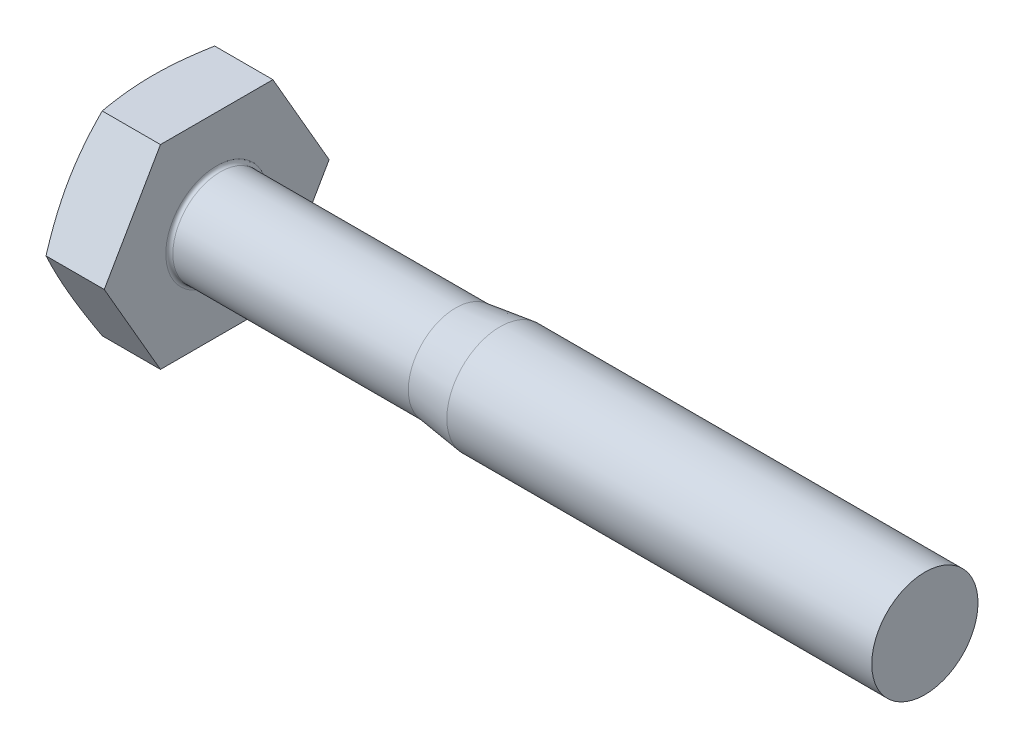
ISO-10303-21;
HEADER;
FILE_DESCRIPTION(('STEP AP214'),'2;1');
FILE_NAME('part.step','',(''),(''),'','','');
FILE_SCHEMA(('AUTOMOTIVE_DESIGN { 1 0 10303 214 1 1 1 1 }'));
ENDSEC;
DATA;
#1=APPLICATION_CONTEXT('core data for automotive mechanical design processes');
#2=APPLICATION_PROTOCOL_DEFINITION('international standard','automotive_design',2000,#1);
#3=PRODUCT_CONTEXT('',#1,'mechanical');
#4=PRODUCT('Part','Part','',(#3));
#5=PRODUCT_RELATED_PRODUCT_CATEGORY('part','',(#4));
#6=PRODUCT_DEFINITION_FORMATION('','',#4);
#7=PRODUCT_DEFINITION_CONTEXT('part definition',#1,'design');
#8=PRODUCT_DEFINITION('design','',#6,#7);
#9=PRODUCT_DEFINITION_SHAPE('','',#8);
#10=(LENGTH_UNIT() NAMED_UNIT(*) SI_UNIT(.MILLI.,.METRE.));
#11=(NAMED_UNIT(*) PLANE_ANGLE_UNIT() SI_UNIT($,.RADIAN.));
#12=(NAMED_UNIT(*) SI_UNIT($,.STERADIAN.) SOLID_ANGLE_UNIT());
#13=UNCERTAINTY_MEASURE_WITH_UNIT(LENGTH_MEASURE(1.E-05),#10,'distance_accuracy_value','');
#14=(GEOMETRIC_REPRESENTATION_CONTEXT(3) GLOBAL_UNCERTAINTY_ASSIGNED_CONTEXT((#13)) GLOBAL_UNIT_ASSIGNED_CONTEXT((#10,
#11,#12)) REPRESENTATION_CONTEXT('',''));
#15=CARTESIAN_POINT('',(0.,0.,0.));
#16=DIRECTION('',(0.,0.,1.));
#17=DIRECTION('',(1.,0.,0.));
#18=AXIS2_PLACEMENT_3D('',#15,#16,#17);
#19=CARTESIAN_POINT('',(2.,-2.75,-1.58771324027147));
#20=DIRECTION('',(0.,0.5,0.866025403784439));
#21=DIRECTION('',(0.,-0.866025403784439,0.5));
#22=AXIS2_PLACEMENT_3D('',#19,#20,#21);
#23=PLANE('',#22);
#24=CARTESIAN_POINT('',(0.355068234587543,0.00019999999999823,-3.17554195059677));
#25=CARTESIAN_POINT('',(0.331123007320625,-0.113699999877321,-3.10978175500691));
#26=CARTESIAN_POINT('',(0.309340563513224,-0.227975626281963,-3.04380469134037));
#27=CARTESIAN_POINT('',(0.271017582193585,-0.457270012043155,-2.91142151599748));
#28=CARTESIAN_POINT('',(0.25448114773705,-0.572289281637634,-2.84501510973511));
#29=CARTESIAN_POINT('',(0.227733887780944,-0.801794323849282,-2.71251031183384));
#30=CARTESIAN_POINT('',(0.217464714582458,-0.916274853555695,-2.64641494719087));
#31=CARTESIAN_POINT('',(0.203690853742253,-1.14550366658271,-2.51406963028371));
#32=CARTESIAN_POINT('',(0.200183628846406,-1.26025183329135,-2.44781974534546));
#33=CARTESIAN_POINT('',(0.200183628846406,-1.48974816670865,-2.31531997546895));
#34=CARTESIAN_POINT('',(0.203690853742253,-1.60449633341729,-2.2490700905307));
#35=CARTESIAN_POINT('',(0.217464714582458,-1.83372514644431,-2.11672477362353));
#36=CARTESIAN_POINT('',(0.227733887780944,-1.94820567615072,-2.05062940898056));
#37=CARTESIAN_POINT('',(0.254481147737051,-2.17771071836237,-1.91812461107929));
#38=CARTESIAN_POINT('',(0.271017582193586,-2.29272998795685,-1.85171820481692));
#39=CARTESIAN_POINT('',(0.309340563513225,-2.52202437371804,-1.71933502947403));
#40=CARTESIAN_POINT('',(0.331123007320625,-2.63630000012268,-1.6533579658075));
#41=CARTESIAN_POINT('',(0.355068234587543,-2.7502,-1.58759777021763));
#42=B_SPLINE_CURVE_WITH_KNOTS('',3,(#24,#25,#26,#27,#28,#29,#30,#31,#32,#33,#34,#35,#36,#37,#38,
#39,#40,#41),.UNSPECIFIED.,.F.,.F.,(4,2,2,2,2,2,2,2,4),(0.,0.401088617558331,0.802490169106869,
1.20009530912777,1.5975512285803,1.99500714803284,2.39261228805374,2.79401383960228,
3.19510245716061),.UNSPECIFIED.);
#43=CARTESIAN_POINT('',(0.355026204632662,0.,-3.17542648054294));
#44=VERTEX_POINT('',#43);
#45=CARTESIAN_POINT('',(0.355026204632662,-2.75,-1.58771324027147));
#46=VERTEX_POINT('',#45);
#47=EDGE_CURVE('E47',#44,#46,#42,.T.);
#48=ORIENTED_EDGE('',*,*,#47,.F.);
#49=DIRECTION('',(-1.,0.,0.));
#50=VECTOR('',#49,1.);
#51=CARTESIAN_POINT('',(2.,0.,-3.17542648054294));
#52=LINE('',#51,#50);
#53=CARTESIAN_POINT('',(2.,0.,-3.17542648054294));
#54=VERTEX_POINT('',#53);
#55=EDGE_CURVE('E118',#54,#44,#52,.T.);
#56=ORIENTED_EDGE('',*,*,#55,.F.);
#57=DIRECTION('',(0.,0.866025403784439,-0.5));
#58=VECTOR('',#57,1.);
#59=CARTESIAN_POINT('',(2.,-2.75,-1.58771324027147));
#60=LINE('',#59,#58);
#61=CARTESIAN_POINT('',(2.,-2.75,-1.58771324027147));
#62=VERTEX_POINT('',#61);
#63=EDGE_CURVE('E157',#62,#54,#60,.T.);
#64=ORIENTED_EDGE('',*,*,#63,.F.);
#65=DIRECTION('',(-1.,0.,0.));
#66=VECTOR('',#65,1.);
#67=CARTESIAN_POINT('',(2.,-2.75,-1.58771324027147));
#68=LINE('',#67,#66);
#69=EDGE_CURVE('E112',#62,#46,#68,.T.);
#70=ORIENTED_EDGE('',*,*,#69,.T.);
#71=EDGE_LOOP('',(#48,#56,#64,#70));
#72=FACE_BOUND('',#71,.T.);
#73=ADVANCED_FACE('F32',(#72),#23,.F.);
#74=CARTESIAN_POINT('',(2.,0.,-3.17542648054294));
#75=DIRECTION('',(0.,-0.5,0.866025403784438));
#76=DIRECTION('',(0.,-0.866025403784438,-0.5));
#77=AXIS2_PLACEMENT_3D('',#74,#75,#76);
#78=PLANE('',#77);
#79=CARTESIAN_POINT('',(0.355068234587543,2.7502,-1.58759777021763));
#80=CARTESIAN_POINT('',(0.331123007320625,2.63630000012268,-1.65335796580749));
#81=CARTESIAN_POINT('',(0.309340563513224,2.52202437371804,-1.71933502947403));
#82=CARTESIAN_POINT('',(0.271017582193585,2.29272998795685,-1.85171820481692));
#83=CARTESIAN_POINT('',(0.25448114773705,2.17771071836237,-1.91812461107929));
#84=CARTESIAN_POINT('',(0.227733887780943,1.94820567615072,-2.05062940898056));
#85=CARTESIAN_POINT('',(0.217464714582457,1.83372514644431,-2.11672477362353));
#86=CARTESIAN_POINT('',(0.203690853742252,1.60449633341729,-2.24907009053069));
#87=CARTESIAN_POINT('',(0.200183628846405,1.48974816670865,-2.31531997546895));
#88=CARTESIAN_POINT('',(0.200183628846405,1.26025183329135,-2.44781974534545));
#89=CARTESIAN_POINT('',(0.203690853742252,1.14550366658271,-2.51406963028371));
#90=CARTESIAN_POINT('',(0.217464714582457,0.916274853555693,-2.64641494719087));
#91=CARTESIAN_POINT('',(0.227733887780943,0.80179432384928,-2.71251031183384));
#92=CARTESIAN_POINT('',(0.25448114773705,0.572289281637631,-2.84501510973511));
#93=CARTESIAN_POINT('',(0.271017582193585,0.457270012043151,-2.91142151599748));
#94=CARTESIAN_POINT('',(0.309340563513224,0.22797562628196,-3.04380469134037));
#95=CARTESIAN_POINT('',(0.331123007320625,0.113699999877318,-3.10978175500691));
#96=CARTESIAN_POINT('',(0.355068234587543,-0.000200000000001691,-3.17554195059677));
#97=B_SPLINE_CURVE_WITH_KNOTS('',3,(#79,#80,#81,#82,#83,#84,#85,#86,#87,#88,#89,#90,#91,#92,#93,
#94,#95,#96),.UNSPECIFIED.,.F.,.F.,(4,2,2,2,2,2,2,2,4),(0.,0.401088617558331,0.80249016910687,
1.20009530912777,1.59755122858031,1.99500714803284,2.39261228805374,2.79401383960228,
3.19510245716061),.UNSPECIFIED.);
#98=CARTESIAN_POINT('',(0.355026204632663,2.75,-1.58771324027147));
#99=VERTEX_POINT('',#98);
#100=EDGE_CURVE('E150',#99,#44,#97,.T.);
#101=ORIENTED_EDGE('',*,*,#100,.F.);
#102=DIRECTION('',(-1.,0.,0.));
#103=VECTOR('',#102,1.);
#104=CARTESIAN_POINT('',(2.,2.75,-1.58771324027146));
#105=LINE('',#104,#103);
#106=CARTESIAN_POINT('',(2.,2.75,-1.58771324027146));
#107=VERTEX_POINT('',#106);
#108=EDGE_CURVE('E110',#107,#99,#105,.T.);
#109=ORIENTED_EDGE('',*,*,#108,.F.);
#110=DIRECTION('',(0.,0.866025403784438,0.5));
#111=VECTOR('',#110,1.);
#112=CARTESIAN_POINT('',(2.,0.,-3.17542648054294));
#113=LINE('',#112,#111);
#114=EDGE_CURVE('E154',#54,#107,#113,.T.);
#115=ORIENTED_EDGE('',*,*,#114,.F.);
#116=ORIENTED_EDGE('',*,*,#55,.T.);
#117=EDGE_LOOP('',(#101,#109,#115,#116));
#118=FACE_BOUND('',#117,.T.);
#119=ADVANCED_FACE('F139',(#118),#78,.F.);
#120=CARTESIAN_POINT('',(2.,2.75,-1.58771324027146));
#121=DIRECTION('',(0.,-1.,0.));
#122=DIRECTION('',(0.,0.,-1.));
#123=AXIS2_PLACEMENT_3D('',#120,#121,#122);
#124=PLANE('',#123);
#125=CARTESIAN_POINT('',(1.02180493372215,2.75,-4.18466418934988));
#126=CARTESIAN_POINT('',(0.984029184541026,2.75,-4.06043601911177));
#127=CARTESIAN_POINT('',(0.946698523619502,2.75,-3.93607007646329));
#128=CARTESIAN_POINT('',(0.873173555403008,2.75,-3.68699229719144));
#129=CARTESIAN_POINT('',(0.836979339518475,2.75,-3.56228043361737));
#130=CARTESIAN_POINT('',(0.765912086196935,2.75,-3.31222289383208));
#131=CARTESIAN_POINT('',(0.731041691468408,2.75,-3.18687646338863));
#132=CARTESIAN_POINT('',(0.663035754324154,2.75,-2.93571540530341));
#133=CARTESIAN_POINT('',(0.629900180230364,2.75,-2.80990078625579));
#134=CARTESIAN_POINT('',(0.566197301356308,2.75,-2.55931264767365));
#135=CARTESIAN_POINT('',(0.535602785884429,2.75,-2.4345461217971));
#136=CARTESIAN_POINT('',(0.477051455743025,2.75,-2.184397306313));
#137=CARTESIAN_POINT('',(0.449094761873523,2.75,-2.0590149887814));
#138=CARTESIAN_POINT('',(0.370146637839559,2.75,-1.68189911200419));
#139=CARTESIAN_POINT('',(0.324042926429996,2.75,-1.42906708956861));
#140=CARTESIAN_POINT('',(0.271566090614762,2.75,-1.06200278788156));
#141=CARTESIAN_POINT('',(0.257356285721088,2.75,-0.948883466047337));
#142=CARTESIAN_POINT('',(0.233368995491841,2.75,-0.722180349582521));
#143=CARTESIAN_POINT('',(0.223590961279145,2.75,-0.608596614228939));
#144=CARTESIAN_POINT('',(0.208933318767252,2.75,-0.381182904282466));
#145=CARTESIAN_POINT('',(0.204050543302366,2.75,-0.267353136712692));
#146=CARTESIAN_POINT('',(0.199431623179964,2.75,-0.0395878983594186));
#147=CARTESIAN_POINT('',(0.199695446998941,2.75,0.0743475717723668));
#148=CARTESIAN_POINT('',(0.20536982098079,2.75,0.30268219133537));
#149=CARTESIAN_POINT('',(0.210807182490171,2.75,0.417080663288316));
#150=CARTESIAN_POINT('',(0.226579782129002,2.75,0.6455406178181));
#151=CARTESIAN_POINT('',(0.236915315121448,2.75,0.759602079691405));
#152=CARTESIAN_POINT('',(0.262003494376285,2.75,0.987328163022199));
#153=CARTESIAN_POINT('',(0.276759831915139,2.75,1.10099237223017));
#154=CARTESIAN_POINT('',(0.310100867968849,2.75,1.32775044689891));
#155=CARTESIAN_POINT('',(0.328685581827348,2.75,1.44084431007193));
#156=CARTESIAN_POINT('',(0.39209052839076,2.75,1.79506991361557));
#157=CARTESIAN_POINT('',(0.442664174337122,2.75,2.03516887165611));
#158=CARTESIAN_POINT('',(0.553526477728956,2.75,2.51311988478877));
#159=CARTESIAN_POINT('',(0.613818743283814,2.75,2.75097107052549));
#160=CARTESIAN_POINT('',(0.74084566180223,2.75,3.22526685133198));
#161=CARTESIAN_POINT('',(0.807588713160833,2.75,3.46170917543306));
#162=CARTESIAN_POINT('',(0.945321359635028,2.75,3.93329901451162));
#163=CARTESIAN_POINT('',(1.01631025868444,2.75,4.16844673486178));
#164=CARTESIAN_POINT('',(1.16035963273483,2.75,4.63505812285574));
#165=CARTESIAN_POINT('',(1.23338567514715,2.75,4.86653246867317));
#166=CARTESIAN_POINT('',(1.38147888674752,2.75,5.32883776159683));
#167=CARTESIAN_POINT('',(1.45654615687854,2.75,5.55966867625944));
#168=CARTESIAN_POINT('',(1.60787522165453,2.75,6.01995774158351));
#169=CARTESIAN_POINT('',(1.68413133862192,2.75,6.24941776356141));
#170=CARTESIAN_POINT('',(1.83776576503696,2.75,6.70794092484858));
#171=CARTESIAN_POINT('',(1.91514398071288,2.75,6.93700409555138));
#172=CARTESIAN_POINT('',(1.99291392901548,2.75,7.16593229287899));
#173=B_SPLINE_CURVE_WITH_KNOTS('',3,(#125,#126,#127,#128,#129,#130,#131,#132,#133,#134,#135,
#136,#137,#138,#139,#140,#141,#142,#143,#144,#145,#146,#147,#148,#149,#150,#151,#152,#153,#154,
#155,#156,#157,#158,#159,#160,#161,#162,#163,#164,#165,#166,#167,#168,#169,#170,#171,#172),
.UNSPECIFIED.,.F.,.F.,(4,2,2,2,2,2,2,2,2,2,2,2,2,2,2,2,2,2,2,2,2,2,2,4),(0.,0.389536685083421,
0.779104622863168,1.16941322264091,1.55971469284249,1.94507331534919,2.33044957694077,
3.10080042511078,3.44275550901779,3.78466823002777,4.12635959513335,4.46804886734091,
4.81151861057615,5.15500903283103,5.49878706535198,5.84256647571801,6.57830519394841,
7.31431769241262,8.05130166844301,8.78816515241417,9.51631330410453,10.2444975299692,
10.9698921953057,11.6952265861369),.UNSPECIFIED.);
#174=CARTESIAN_POINT('',(0.355026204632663,2.75,1.58771324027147));
#175=VERTEX_POINT('',#174);
#176=EDGE_CURVE('E104',#175,#99,#173,.F.);
#177=ORIENTED_EDGE('',*,*,#176,.F.);
#178=DIRECTION('',(-1.,0.,0.));
#179=VECTOR('',#178,1.);
#180=CARTESIAN_POINT('',(2.,2.75,1.58771324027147));
#181=LINE('',#180,#179);
#182=CARTESIAN_POINT('',(2.,2.75,1.58771324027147));
#183=VERTEX_POINT('',#182);
#184=EDGE_CURVE('E103',#183,#175,#181,.T.);
#185=ORIENTED_EDGE('',*,*,#184,.F.);
#186=DIRECTION('',(0.,0.,1.));
#187=VECTOR('',#186,1.);
#188=CARTESIAN_POINT('',(2.,2.75,-1.58771324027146));
#189=LINE('',#188,#187);
#190=EDGE_CURVE('E156',#107,#183,#189,.T.);
#191=ORIENTED_EDGE('',*,*,#190,.F.);
#192=ORIENTED_EDGE('',*,*,#108,.T.);
#193=EDGE_LOOP('',(#177,#185,#191,#192));
#194=FACE_BOUND('',#193,.T.);
#195=ADVANCED_FACE('F144',(#194),#124,.F.);
#196=CARTESIAN_POINT('',(2.,2.75,1.58771324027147));
#197=DIRECTION('',(0.,-0.5,-0.866025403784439));
#198=DIRECTION('',(0.,0.866025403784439,-0.5));
#199=AXIS2_PLACEMENT_3D('',#196,#197,#198);
#200=PLANE('',#199);
#201=CARTESIAN_POINT('',(0.355068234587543,-0.000199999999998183,3.17554195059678));
#202=CARTESIAN_POINT('',(0.331123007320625,0.113699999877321,3.10978175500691));
#203=CARTESIAN_POINT('',(0.309340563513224,0.227975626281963,3.04380469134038));
#204=CARTESIAN_POINT('',(0.271017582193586,0.457270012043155,2.91142151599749));
#205=CARTESIAN_POINT('',(0.25448114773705,0.572289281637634,2.84501510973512));
#206=CARTESIAN_POINT('',(0.227733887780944,0.801794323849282,2.71251031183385));
#207=CARTESIAN_POINT('',(0.217464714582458,0.916274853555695,2.64641494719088));
#208=CARTESIAN_POINT('',(0.203690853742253,1.14550366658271,2.51406963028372));
#209=CARTESIAN_POINT('',(0.200183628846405,1.26025183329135,2.44781974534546));
#210=CARTESIAN_POINT('',(0.200183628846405,1.48974816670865,2.31531997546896));
#211=CARTESIAN_POINT('',(0.203690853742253,1.60449633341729,2.2490700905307));
#212=CARTESIAN_POINT('',(0.217464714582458,1.83372514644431,2.11672477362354));
#213=CARTESIAN_POINT('',(0.227733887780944,1.94820567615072,2.05062940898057));
#214=CARTESIAN_POINT('',(0.25448114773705,2.17771071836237,1.9181246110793));
#215=CARTESIAN_POINT('',(0.271017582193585,2.29272998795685,1.85171820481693));
#216=CARTESIAN_POINT('',(0.309340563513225,2.52202437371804,1.71933502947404));
#217=CARTESIAN_POINT('',(0.331123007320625,2.63630000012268,1.65335796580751));
#218=CARTESIAN_POINT('',(0.355068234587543,2.7502,1.58759777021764));
#219=B_SPLINE_CURVE_WITH_KNOTS('',3,(#201,#202,#203,#204,#205,#206,#207,#208,#209,#210,#211,
#212,#213,#214,#215,#216,#217,#218),.UNSPECIFIED.,.F.,.F.,(4,2,2,2,2,2,2,2,4),(0.,
0.401088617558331,0.802490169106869,1.20009530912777,1.5975512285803,1.99500714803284,
2.39261228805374,2.79401383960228,3.19510245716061),.UNSPECIFIED.);
#220=CARTESIAN_POINT('',(0.355026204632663,0.,3.17542648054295));
#221=VERTEX_POINT('',#220);
#222=EDGE_CURVE('E87',#221,#175,#219,.T.);
#223=ORIENTED_EDGE('',*,*,#222,.F.);
#224=DIRECTION('',(-1.,0.,0.));
#225=VECTOR('',#224,1.);
#226=CARTESIAN_POINT('',(2.,0.,3.17542648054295));
#227=LINE('',#226,#225);
#228=CARTESIAN_POINT('',(2.,0.,3.17542648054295));
#229=VERTEX_POINT('',#228);
#230=EDGE_CURVE('E100',#229,#221,#227,.T.);
#231=ORIENTED_EDGE('',*,*,#230,.F.);
#232=DIRECTION('',(0.,-0.866025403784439,0.5));
#233=VECTOR('',#232,1.);
#234=CARTESIAN_POINT('',(2.,2.75,1.58771324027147));
#235=LINE('',#234,#233);
#236=EDGE_CURVE('E164',#183,#229,#235,.T.);
#237=ORIENTED_EDGE('',*,*,#236,.F.);
#238=ORIENTED_EDGE('',*,*,#184,.T.);
#239=EDGE_LOOP('',(#223,#231,#237,#238));
#240=FACE_BOUND('',#239,.T.);
#241=ADVANCED_FACE('F98',(#240),#200,.F.);
#242=CARTESIAN_POINT('',(2.,0.,3.17542648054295));
#243=DIRECTION('',(0.,0.5,-0.866025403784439));
#244=DIRECTION('',(0.,0.866025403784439,0.5));
#245=AXIS2_PLACEMENT_3D('',#242,#243,#244);
#246=PLANE('',#245);
#247=CARTESIAN_POINT('',(0.355068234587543,-2.7502,1.58759777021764));
#248=CARTESIAN_POINT('',(0.331123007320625,-2.63630000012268,1.65335796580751));
#249=CARTESIAN_POINT('',(0.309340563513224,-2.52202437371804,1.71933502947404));
#250=CARTESIAN_POINT('',(0.271017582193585,-2.29272998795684,1.85171820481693));
#251=CARTESIAN_POINT('',(0.25448114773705,-2.17771071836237,1.9181246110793));
#252=CARTESIAN_POINT('',(0.227733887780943,-1.94820567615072,2.05062940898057));
#253=CARTESIAN_POINT('',(0.217464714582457,-1.8337251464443,2.11672477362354));
#254=CARTESIAN_POINT('',(0.203690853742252,-1.60449633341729,2.2490700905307));
#255=CARTESIAN_POINT('',(0.200183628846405,-1.48974816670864,2.31531997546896));
#256=CARTESIAN_POINT('',(0.200183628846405,-1.26025183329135,2.44781974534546));
#257=CARTESIAN_POINT('',(0.203690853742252,-1.14550366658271,2.51406963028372));
#258=CARTESIAN_POINT('',(0.217464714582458,-0.916274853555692,2.64641494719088));
#259=CARTESIAN_POINT('',(0.227733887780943,-0.801794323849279,2.71251031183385));
#260=CARTESIAN_POINT('',(0.25448114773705,-0.57228928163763,2.84501510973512));
#261=CARTESIAN_POINT('',(0.271017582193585,-0.457270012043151,2.91142151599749));
#262=CARTESIAN_POINT('',(0.309340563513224,-0.227975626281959,3.04380469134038));
#263=CARTESIAN_POINT('',(0.331123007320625,-0.113699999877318,3.10978175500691));
#264=CARTESIAN_POINT('',(0.355068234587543,0.000200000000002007,3.17554195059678));
#265=B_SPLINE_CURVE_WITH_KNOTS('',3,(#247,#248,#249,#250,#251,#252,#253,#254,#255,#256,#257,
#258,#259,#260,#261,#262,#263,#264),.UNSPECIFIED.,.F.,.F.,(4,2,2,2,2,2,2,2,4),(0.,
0.401088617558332,0.80249016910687,1.20009530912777,1.59755122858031,1.99500714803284,
2.39261228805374,2.79401383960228,3.19510245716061),.UNSPECIFIED.);
#266=CARTESIAN_POINT('',(0.355026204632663,-2.75,1.58771324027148));
#267=VERTEX_POINT('',#266);
#268=EDGE_CURVE('E84',#267,#221,#265,.T.);
#269=ORIENTED_EDGE('',*,*,#268,.F.);
#270=DIRECTION('',(-1.,0.,0.));
#271=VECTOR('',#270,1.);
#272=CARTESIAN_POINT('',(2.,-2.75,1.58771324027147));
#273=LINE('',#272,#271);
#274=CARTESIAN_POINT('',(2.,-2.75,1.58771324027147));
#275=VERTEX_POINT('',#274);
#276=EDGE_CURVE('E108',#275,#267,#273,.T.);
#277=ORIENTED_EDGE('',*,*,#276,.F.);
#278=DIRECTION('',(0.,-0.866025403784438,-0.5));
#279=VECTOR('',#278,1.);
#280=CARTESIAN_POINT('',(2.,0.,3.17542648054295));
#281=LINE('',#280,#279);
#282=EDGE_CURVE('E107',#229,#275,#281,.T.);
#283=ORIENTED_EDGE('',*,*,#282,.F.);
#284=ORIENTED_EDGE('',*,*,#230,.T.);
#285=EDGE_LOOP('',(#269,#277,#283,#284));
#286=FACE_BOUND('',#285,.T.);
#287=ADVANCED_FACE('F106',(#286),#246,.F.);
#288=CARTESIAN_POINT('',(2.,-2.75,1.58771324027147));
#289=DIRECTION('',(0.,1.,0.));
#290=DIRECTION('',(0.,0.,1.));
#291=AXIS2_PLACEMENT_3D('',#288,#289,#290);
#292=PLANE('',#291);
#293=CARTESIAN_POINT('',(1.02180493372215,-2.75,-4.18466418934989));
#294=CARTESIAN_POINT('',(0.984029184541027,-2.75,-4.06043601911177));
#295=CARTESIAN_POINT('',(0.946698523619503,-2.75,-3.93607007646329));
#296=CARTESIAN_POINT('',(0.873173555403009,-2.75,-3.68699229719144));
#297=CARTESIAN_POINT('',(0.836979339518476,-2.75,-3.56228043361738));
#298=CARTESIAN_POINT('',(0.765912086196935,-2.75,-3.31222289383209));
#299=CARTESIAN_POINT('',(0.731041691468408,-2.75,-3.18687646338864));
#300=CARTESIAN_POINT('',(0.663035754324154,-2.75,-2.93571540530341));
#301=CARTESIAN_POINT('',(0.629900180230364,-2.75,-2.80990078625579));
#302=CARTESIAN_POINT('',(0.566197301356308,-2.75,-2.55931264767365));
#303=CARTESIAN_POINT('',(0.535602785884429,-2.75,-2.4345461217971));
#304=CARTESIAN_POINT('',(0.477051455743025,-2.75,-2.184397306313));
#305=CARTESIAN_POINT('',(0.449094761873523,-2.75,-2.0590149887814));
#306=CARTESIAN_POINT('',(0.370146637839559,-2.75,-1.68189911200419));
#307=CARTESIAN_POINT('',(0.324042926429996,-2.75,-1.42906708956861));
#308=CARTESIAN_POINT('',(0.271566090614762,-2.75,-1.06200278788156));
#309=CARTESIAN_POINT('',(0.257356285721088,-2.75,-0.948883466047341));
#310=CARTESIAN_POINT('',(0.233368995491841,-2.75,-0.722180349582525));
#311=CARTESIAN_POINT('',(0.223590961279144,-2.75,-0.608596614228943));
#312=CARTESIAN_POINT('',(0.208933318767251,-2.75,-0.38118290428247));
#313=CARTESIAN_POINT('',(0.204050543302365,-2.75,-0.267353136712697));
#314=CARTESIAN_POINT('',(0.199431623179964,-2.75,-0.0395878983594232));
#315=CARTESIAN_POINT('',(0.19969544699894,-2.75,0.0743475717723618));
#316=CARTESIAN_POINT('',(0.205369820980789,-2.75,0.302682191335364));
#317=CARTESIAN_POINT('',(0.21080718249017,-2.75,0.41708066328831));
#318=CARTESIAN_POINT('',(0.226579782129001,-2.75,0.645540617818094));
#319=CARTESIAN_POINT('',(0.236915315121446,-2.75,0.759602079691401));
#320=CARTESIAN_POINT('',(0.262003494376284,-2.75,0.987328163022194));
#321=CARTESIAN_POINT('',(0.276759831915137,-2.75,1.10099237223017));
#322=CARTESIAN_POINT('',(0.310100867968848,-2.75,1.3277504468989));
#323=CARTESIAN_POINT('',(0.328685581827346,-2.75,1.44084431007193));
#324=CARTESIAN_POINT('',(0.392090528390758,-2.75,1.79506991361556));
#325=CARTESIAN_POINT('',(0.442664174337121,-2.75,2.03516887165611));
#326=CARTESIAN_POINT('',(0.553526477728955,-2.75,2.51311988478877));
#327=CARTESIAN_POINT('',(0.613818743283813,-2.75,2.75097107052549));
#328=CARTESIAN_POINT('',(0.74084566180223,-2.75,3.22526685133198));
#329=CARTESIAN_POINT('',(0.807588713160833,-2.75,3.46170917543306));
#330=CARTESIAN_POINT('',(0.945321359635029,-2.75,3.93329901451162));
#331=CARTESIAN_POINT('',(1.01631025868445,-2.75,4.16844673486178));
#332=CARTESIAN_POINT('',(1.16035963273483,-2.75,4.63505812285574));
#333=CARTESIAN_POINT('',(1.23338567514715,-2.75,4.86653246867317));
#334=CARTESIAN_POINT('',(1.38147888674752,-2.75,5.32883776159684));
#335=CARTESIAN_POINT('',(1.45654615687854,-2.75,5.55966867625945));
#336=CARTESIAN_POINT('',(1.60787522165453,-2.75,6.01995774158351));
#337=CARTESIAN_POINT('',(1.68413133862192,-2.75,6.24941776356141));
#338=CARTESIAN_POINT('',(1.83776576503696,-2.75,6.70794092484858));
#339=CARTESIAN_POINT('',(1.91514398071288,-2.75,6.93700409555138));
#340=CARTESIAN_POINT('',(1.99291392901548,-2.75,7.16593229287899));
#341=B_SPLINE_CURVE_WITH_KNOTS('',3,(#293,#294,#295,#296,#297,#298,#299,#300,#301,#302,#303,
#304,#305,#306,#307,#308,#309,#310,#311,#312,#313,#314,#315,#316,#317,#318,#319,#320,#321,#322,
#323,#324,#325,#326,#327,#328,#329,#330,#331,#332,#333,#334,#335,#336,#337,#338,#339,#340),
.UNSPECIFIED.,.F.,.F.,(4,2,2,2,2,2,2,2,2,2,2,2,2,2,2,2,2,2,2,2,2,2,2,4),(0.,0.389536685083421,
0.779104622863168,1.16941322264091,1.55971469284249,1.94507331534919,2.33044957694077,
3.10080042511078,3.44275550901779,3.78466823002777,4.12635959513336,4.46804886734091,
4.81151861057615,5.15500903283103,5.49878706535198,5.84256647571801,6.57830519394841,
7.31431769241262,8.05130166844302,8.78816515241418,9.51631330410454,10.2444975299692,
10.9698921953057,11.6952265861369),.UNSPECIFIED.);
#342=EDGE_CURVE('E89',#46,#267,#341,.T.);
#343=ORIENTED_EDGE('',*,*,#342,.F.);
#344=ORIENTED_EDGE('',*,*,#69,.F.);
#345=DIRECTION('',(0.,0.,-1.));
#346=VECTOR('',#345,1.);
#347=CARTESIAN_POINT('',(2.,-2.75,1.58771324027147));
#348=LINE('',#347,#346);
#349=EDGE_CURVE('E55',#275,#62,#348,.T.);
#350=ORIENTED_EDGE('',*,*,#349,.F.);
#351=ORIENTED_EDGE('',*,*,#276,.T.);
#352=EDGE_LOOP('',(#343,#344,#350,#351));
#353=FACE_BOUND('',#352,.T.);
#354=ADVANCED_FACE('F168',(#353),#292,.F.);
#355=CARTESIAN_POINT('',(2.,0.,-3.17542648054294));
#356=DIRECTION('',(1.,0.,0.));
#357=DIRECTION('',(0.,0.,-1.));
#358=AXIS2_PLACEMENT_3D('',#355,#356,#357);
#359=PLANE('',#358);
#360=CARTESIAN_POINT('',(2.,0.,0.));
#361=DIRECTION('',(1.,0.,0.));
#362=DIRECTION('',(0.,0.,-1.));
#363=AXIS2_PLACEMENT_3D('',#360,#361,#362);
#364=CIRCLE('',#363,1.4375);
#365=CARTESIAN_POINT('',(2.,0.,-1.4375));
#366=VERTEX_POINT('',#365);
#367=EDGE_CURVE('E40',#366,#366,#364,.F.);
#368=ORIENTED_EDGE('',*,*,#367,.T.);
#369=EDGE_LOOP('',(#368));
#370=FACE_BOUND('',#369,.T.);
#371=ORIENTED_EDGE('',*,*,#63,.T.);
#372=ORIENTED_EDGE('',*,*,#114,.T.);
#373=ORIENTED_EDGE('',*,*,#190,.T.);
#374=ORIENTED_EDGE('',*,*,#236,.T.);
#375=ORIENTED_EDGE('',*,*,#282,.T.);
#376=ORIENTED_EDGE('',*,*,#349,.T.);
#377=EDGE_LOOP('',(#371,#372,#373,#374,#375,#376));
#378=FACE_BOUND('',#377,.T.);
#379=ADVANCED_FACE('F123',(#370,#378),#359,.T.);
#380=CARTESIAN_POINT('',(0.,0.,0.));
#381=DIRECTION('',(1.,0.,0.));
#382=DIRECTION('',(0.,0.,-1.));
#383=AXIS2_PLACEMENT_3D('',#380,#381,#382);
#384=CONICAL_SURFACE('',#383,2.20000000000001,1.22173047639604);
#385=CARTESIAN_POINT('',(0.,0.,0.));
#386=DIRECTION('',(-1.,0.,0.));
#387=DIRECTION('',(0.,0.,1.));
#388=AXIS2_PLACEMENT_3D('',#385,#386,#387);
#389=CIRCLE('',#388,2.20000000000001);
#390=CARTESIAN_POINT('',(0.,0.,2.20000000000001));
#391=VERTEX_POINT('',#390);
#392=EDGE_CURVE('E169',#391,#391,#389,.T.);
#393=ORIENTED_EDGE('',*,*,#392,.F.);
#394=EDGE_LOOP('',(#393));
#395=FACE_BOUND('',#394,.T.);
#396=ORIENTED_EDGE('',*,*,#47,.T.);
#397=ORIENTED_EDGE('',*,*,#342,.T.);
#398=ORIENTED_EDGE('',*,*,#268,.T.);
#399=ORIENTED_EDGE('',*,*,#222,.T.);
#400=ORIENTED_EDGE('',*,*,#176,.T.);
#401=ORIENTED_EDGE('',*,*,#100,.T.);
#402=EDGE_LOOP('',(#396,#397,#398,#399,#400,#401));
#403=FACE_BOUND('',#402,.T.);
#404=ADVANCED_FACE('F86',(#395,#403),#384,.T.);
#405=CARTESIAN_POINT('',(0.,0.,-3.17542648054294));
#406=DIRECTION('',(1.,0.,0.));
#407=DIRECTION('',(0.,0.,-1.));
#408=AXIS2_PLACEMENT_3D('',#405,#406,#407);
#409=PLANE('',#408);
#410=CARTESIAN_POINT('',(0.,0.,0.));
#411=DIRECTION('',(-1.,0.,0.));
#412=DIRECTION('',(0.,0.,1.));
#413=AXIS2_PLACEMENT_3D('',#410,#411,#412);
#414=CIRCLE('',#413,1.8);
#415=CARTESIAN_POINT('',(0.,0.,1.8));
#416=VERTEX_POINT('',#415);
#417=EDGE_CURVE('E242',#416,#416,#414,.T.);
#418=ORIENTED_EDGE('',*,*,#417,.F.);
#419=EDGE_LOOP('',(#418));
#420=FACE_BOUND('',#419,.T.);
#421=ORIENTED_EDGE('',*,*,#392,.T.);
#422=EDGE_LOOP('',(#421));
#423=FACE_BOUND('',#422,.T.);
#424=ADVANCED_FACE('F190',(#420,#423),#409,.F.);
#425=CARTESIAN_POINT('',(0.4,0.,0.));
#426=DIRECTION('',(-1.,0.,0.));
#427=DIRECTION('',(0.,0.,1.));
#428=AXIS2_PLACEMENT_3D('',#425,#426,#427);
#429=CYLINDRICAL_SURFACE('',#428,1.8);
#430=CARTESIAN_POINT('',(0.4,0.,0.));
#431=DIRECTION('',(-1.,0.,0.));
#432=DIRECTION('',(0.,0.,1.));
#433=AXIS2_PLACEMENT_3D('',#430,#431,#432);
#434=CIRCLE('',#433,1.8);
#435=CARTESIAN_POINT('',(0.4,0.,1.8));
#436=VERTEX_POINT('',#435);
#437=EDGE_CURVE('E172',#436,#436,#434,.T.);
#438=ORIENTED_EDGE('',*,*,#437,.F.);
#439=EDGE_LOOP('',(#438));
#440=FACE_BOUND('',#439,.T.);
#441=ORIENTED_EDGE('',*,*,#417,.T.);
#442=EDGE_LOOP('',(#441));
#443=FACE_BOUND('',#442,.T.);
#444=ADVANCED_FACE('F192',(#440,#443),#429,.F.);
#445=CARTESIAN_POINT('',(0.4,0.,0.));
#446=DIRECTION('',(-1.,0.,0.));
#447=DIRECTION('',(0.,0.,1.));
#448=AXIS2_PLACEMENT_3D('',#445,#446,#447);
#449=PLANE('',#448);
#450=ORIENTED_EDGE('',*,*,#437,.T.);
#451=EDGE_LOOP('',(#450));
#452=FACE_BOUND('',#451,.T.);
#453=ADVANCED_FACE('F237',(#452),#449,.T.);
#454=CARTESIAN_POINT('',(8.75,0.,0.));
#455=DIRECTION('',(1.,0.,0.));
#456=DIRECTION('',(0.,0.,-1.));
#457=AXIS2_PLACEMENT_3D('',#454,#455,#456);
#458=CONICAL_SURFACE('',#457,1.3375,0.129275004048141);
#459=CARTESIAN_POINT('',(10.,0.,0.));
#460=DIRECTION('',(-1.,0.,0.));
#461=DIRECTION('',(0.,0.,1.));
#462=AXIS2_PLACEMENT_3D('',#459,#460,#461);
#463=CIRCLE('',#462,1.5);
#464=CARTESIAN_POINT('',(10.,0.,1.5));
#465=VERTEX_POINT('',#464);
#466=EDGE_CURVE('E245',#465,#465,#463,.T.);
#467=ORIENTED_EDGE('',*,*,#466,.T.);
#468=EDGE_LOOP('',(#467));
#469=FACE_BOUND('',#468,.T.);
#470=CARTESIAN_POINT('',(8.75,0.,0.));
#471=DIRECTION('',(-1.,0.,0.));
#472=DIRECTION('',(0.,0.,1.));
#473=AXIS2_PLACEMENT_3D('',#470,#471,#472);
#474=CIRCLE('',#473,1.3375);
#475=CARTESIAN_POINT('',(8.75,0.,1.3375));
#476=VERTEX_POINT('',#475);
#477=EDGE_CURVE('E249',#476,#476,#474,.T.);
#478=ORIENTED_EDGE('',*,*,#477,.F.);
#479=EDGE_LOOP('',(#478));
#480=FACE_BOUND('',#479,.T.);
#481=ADVANCED_FACE('F257',(#469,#480),#458,.T.);
#482=CARTESIAN_POINT('',(-2.69717570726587,0.,0.));
#483=DIRECTION('',(-1.,0.,0.));
#484=DIRECTION('',(0.,0.,1.));
#485=AXIS2_PLACEMENT_3D('',#482,#483,#484);
#486=CYLINDRICAL_SURFACE('',#485,1.3375);
#487=CARTESIAN_POINT('',(2.1,0.,0.));
#488=DIRECTION('',(1.,0.,0.));
#489=DIRECTION('',(0.,0.,-1.));
#490=AXIS2_PLACEMENT_3D('',#487,#488,#489);
#491=CIRCLE('',#490,1.3375);
#492=CARTESIAN_POINT('',(2.1,0.,-1.3375));
#493=VERTEX_POINT('',#492);
#494=EDGE_CURVE('E11',#493,#493,#491,.T.);
#495=ORIENTED_EDGE('',*,*,#494,.T.);
#496=EDGE_LOOP('',(#495));
#497=FACE_BOUND('',#496,.T.);
#498=ORIENTED_EDGE('',*,*,#477,.T.);
#499=EDGE_LOOP('',(#498));
#500=FACE_BOUND('',#499,.T.);
#501=ADVANCED_FACE('F255',(#497,#500),#486,.T.);
#502=CARTESIAN_POINT('',(22.,0.,0.));
#503=DIRECTION('',(1.,0.,0.));
#504=DIRECTION('',(0.,0.,-1.));
#505=AXIS2_PLACEMENT_3D('',#502,#503,#504);
#506=PLANE('',#505);
#507=CARTESIAN_POINT('',(22.,0.,0.));
#508=DIRECTION('',(1.,0.,0.));
#509=DIRECTION('',(0.,0.,-1.));
#510=AXIS2_PLACEMENT_3D('',#507,#508,#509);
#511=CIRCLE('',#510,1.5);
#512=CARTESIAN_POINT('',(22.,0.,-1.5));
#513=VERTEX_POINT('',#512);
#514=EDGE_CURVE('E149',#513,#513,#511,.T.);
#515=ORIENTED_EDGE('',*,*,#514,.T.);
#516=EDGE_LOOP('',(#515));
#517=FACE_BOUND('',#516,.T.);
#518=ADVANCED_FACE('F133',(#517),#506,.T.);
#519=CARTESIAN_POINT('',(22.,0.,0.));
#520=DIRECTION('',(-1.,0.,0.));
#521=DIRECTION('',(0.,0.,1.));
#522=AXIS2_PLACEMENT_3D('',#519,#520,#521);
#523=CYLINDRICAL_SURFACE('',#522,1.5);
#524=ORIENTED_EDGE('',*,*,#514,.F.);
#525=EDGE_LOOP('',(#524));
#526=FACE_BOUND('',#525,.T.);
#527=ORIENTED_EDGE('',*,*,#466,.F.);
#528=EDGE_LOOP('',(#527));
#529=FACE_BOUND('',#528,.T.);
#530=ADVANCED_FACE('F127',(#526,#529),#523,.T.);
#531=CARTESIAN_POINT('',(2.1,0.,0.));
#532=DIRECTION('',(1.,0.,0.));
#533=DIRECTION('',(0.,0.,-1.));
#534=AXIS2_PLACEMENT_3D('',#531,#532,#533);
#535=TOROIDAL_SURFACE('',#534,1.4375,0.1);
#536=ORIENTED_EDGE('',*,*,#494,.F.);
#537=EDGE_LOOP('',(#536));
#538=FACE_BOUND('',#537,.T.);
#539=ORIENTED_EDGE('',*,*,#367,.F.);
#540=EDGE_LOOP('',(#539));
#541=FACE_BOUND('',#540,.T.);
#542=ADVANCED_FACE('F125',(#538,#541),#535,.F.);
#543=CLOSED_SHELL('',(#73,#119,#195,#241,#287,#354,#379,#404,#424,#444,#453,#481,#501,#518,#530,#542));
#544=MANIFOLD_SOLID_BREP('B2',#543);
#545=ADVANCED_BREP_SHAPE_REPRESENTATION('',(#18,#544),#14);
#546=SHAPE_DEFINITION_REPRESENTATION(#9,#545);
ENDSEC;
END-ISO-10303-21;
